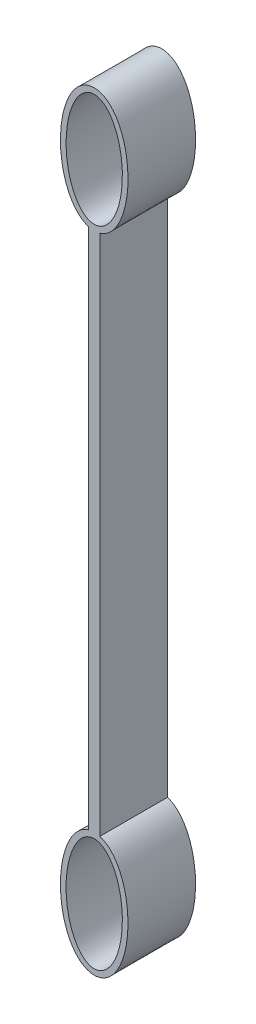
ISO-10303-21;
HEADER;
FILE_DESCRIPTION(('STEP AP214'),'2;1');
FILE_NAME('part.step','',(''),(''),'','','');
FILE_SCHEMA(('AUTOMOTIVE_DESIGN { 1 0 10303 214 1 1 1 1 }'));
ENDSEC;
DATA;
#1=APPLICATION_CONTEXT('core data for automotive mechanical design processes');
#2=APPLICATION_PROTOCOL_DEFINITION('international standard','automotive_design',2000,#1);
#3=PRODUCT_CONTEXT('',#1,'mechanical');
#4=PRODUCT('Part','Part','',(#3));
#5=PRODUCT_RELATED_PRODUCT_CATEGORY('part','',(#4));
#6=PRODUCT_DEFINITION_FORMATION('','',#4);
#7=PRODUCT_DEFINITION_CONTEXT('part definition',#1,'design');
#8=PRODUCT_DEFINITION('design','',#6,#7);
#9=PRODUCT_DEFINITION_SHAPE('','',#8);
#10=(LENGTH_UNIT() NAMED_UNIT(*) SI_UNIT(.MILLI.,.METRE.));
#11=(NAMED_UNIT(*) PLANE_ANGLE_UNIT() SI_UNIT($,.RADIAN.));
#12=(NAMED_UNIT(*) SI_UNIT($,.STERADIAN.) SOLID_ANGLE_UNIT());
#13=UNCERTAINTY_MEASURE_WITH_UNIT(LENGTH_MEASURE(1.E-05),#10,'distance_accuracy_value','');
#14=(GEOMETRIC_REPRESENTATION_CONTEXT(3) GLOBAL_UNCERTAINTY_ASSIGNED_CONTEXT((#13)) GLOBAL_UNIT_ASSIGNED_CONTEXT((#10,
#11,#12)) REPRESENTATION_CONTEXT('',''));
#15=CARTESIAN_POINT('',(0.,0.,0.));
#16=DIRECTION('',(0.,0.,1.));
#17=DIRECTION('',(1.,0.,0.));
#18=AXIS2_PLACEMENT_3D('',#15,#16,#17);
#19=CARTESIAN_POINT('',(6.35,0.,0.));
#20=DIRECTION('',(1.,0.,0.));
#21=DIRECTION('',(0.,0.,-1.));
#22=AXIS2_PLACEMENT_3D('',#19,#20,#21);
#23=PLANE('',#22);
#24=DIRECTION('',(0.,-1.,0.));
#25=VECTOR('',#24,1.);
#26=CARTESIAN_POINT('',(6.35,300.,38.1));
#27=LINE('',#26,#25);
#28=CARTESIAN_POINT('',(6.35,294.569002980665,38.1));
#29=VERTEX_POINT('',#28);
#30=CARTESIAN_POINT('',(6.35000001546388,-294.569002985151,38.1));
#31=VERTEX_POINT('',#30);
#32=EDGE_CURVE('E93',#29,#31,#27,.T.);
#33=ORIENTED_EDGE('',*,*,#32,.T.);
#34=DIRECTION('',(0.,0.,-1.));
#35=VECTOR('',#34,1.);
#36=CARTESIAN_POINT('',(6.35,-294.569002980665,38.1));
#37=LINE('',#36,#35);
#38=CARTESIAN_POINT('',(6.35000001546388,-294.569002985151,-38.1));
#39=VERTEX_POINT('',#38);
#40=EDGE_CURVE('E76',#31,#39,#37,.T.);
#41=ORIENTED_EDGE('',*,*,#40,.T.);
#42=DIRECTION('',(0.,1.,0.));
#43=VECTOR('',#42,1.);
#44=CARTESIAN_POINT('',(6.35,300.,-38.1));
#45=LINE('',#44,#43);
#46=CARTESIAN_POINT('',(6.35,294.569002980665,-38.1));
#47=VERTEX_POINT('',#46);
#48=EDGE_CURVE('E40',#39,#47,#45,.T.);
#49=ORIENTED_EDGE('',*,*,#48,.T.);
#50=DIRECTION('',(0.,0.,-1.));
#51=VECTOR('',#50,1.);
#52=CARTESIAN_POINT('',(6.35,294.569002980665,38.1));
#53=LINE('',#52,#51);
#54=EDGE_CURVE('E50',#47,#29,#53,.F.);
#55=ORIENTED_EDGE('',*,*,#54,.T.);
#56=EDGE_LOOP('',(#33,#41,#49,#55));
#57=FACE_BOUND('',#56,.T.);
#58=ADVANCED_FACE('F32',(#57),#23,.T.);
#59=CARTESIAN_POINT('',(-6.35,0.,0.));
#60=DIRECTION('',(1.,0.,0.));
#61=DIRECTION('',(0.,0.,-1.));
#62=AXIS2_PLACEMENT_3D('',#59,#60,#61);
#63=PLANE('',#62);
#64=DIRECTION('',(0.,0.,-1.));
#65=VECTOR('',#64,1.);
#66=CARTESIAN_POINT('',(-6.35,-294.569002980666,38.1));
#67=LINE('',#66,#65);
#68=CARTESIAN_POINT('',(-6.35000001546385,-294.569002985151,38.1));
#69=VERTEX_POINT('',#68);
#70=CARTESIAN_POINT('',(-6.35000001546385,-294.569002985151,-38.1));
#71=VERTEX_POINT('',#70);
#72=EDGE_CURVE('E74',#69,#71,#67,.T.);
#73=ORIENTED_EDGE('',*,*,#72,.F.);
#74=DIRECTION('',(0.,-1.,0.));
#75=VECTOR('',#74,1.);
#76=CARTESIAN_POINT('',(-6.35,300.,38.1));
#77=LINE('',#76,#75);
#78=CARTESIAN_POINT('',(-6.35000000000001,294.569002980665,38.1));
#79=VERTEX_POINT('',#78);
#80=EDGE_CURVE('E85',#79,#69,#77,.T.);
#81=ORIENTED_EDGE('',*,*,#80,.F.);
#82=DIRECTION('',(0.,0.,-1.));
#83=VECTOR('',#82,1.);
#84=CARTESIAN_POINT('',(-6.35000000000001,294.569002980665,38.1));
#85=LINE('',#84,#83);
#86=CARTESIAN_POINT('',(-6.35,294.569002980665,-38.1));
#87=VERTEX_POINT('',#86);
#88=EDGE_CURVE('E11',#87,#79,#85,.F.);
#89=ORIENTED_EDGE('',*,*,#88,.F.);
#90=DIRECTION('',(0.,1.,0.));
#91=VECTOR('',#90,1.);
#92=CARTESIAN_POINT('',(-6.35,300.,-38.1));
#93=LINE('',#92,#91);
#94=EDGE_CURVE('E86',#71,#87,#93,.T.);
#95=ORIENTED_EDGE('',*,*,#94,.F.);
#96=EDGE_LOOP('',(#73,#81,#89,#95));
#97=FACE_BOUND('',#96,.T.);
#98=ADVANCED_FACE('F83',(#97),#63,.F.);
#99=CARTESIAN_POINT('',(6.35,300.,38.1));
#100=DIRECTION('',(0.,0.,-1.));
#101=DIRECTION('',(-1.,0.,0.));
#102=AXIS2_PLACEMENT_3D('',#99,#100,#101);
#103=PLANE('',#102);
#104=ORIENTED_EDGE('',*,*,#80,.T.);
#105=CARTESIAN_POINT('',(0.,-293.65,38.1));
#106=CARTESIAN_POINT('',(-2.90429625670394,-293.65,38.1));
#107=CARTESIAN_POINT('',(-8.71288877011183,-294.822831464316,38.1));
#108=CARTESIAN_POINT('',(-16.3967252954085,-299.564444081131,38.1));
#109=CARTESIAN_POINT('',(-22.9073740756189,-306.581388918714,38.1));
#110=CARTESIAN_POINT('',(-28.3147395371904,-315.493224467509,38.1));
#111=CARTESIAN_POINT('',(-32.6151855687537,-325.999191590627,38.1));
#112=CARTESIAN_POINT('',(-36.8030834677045,-341.686787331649,38.1));
#113=CARTESIAN_POINT('',(-38.9646110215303,-363.5,38.1));
#114=CARTESIAN_POINT('',(-36.8030834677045,-385.313212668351,38.1));
#115=CARTESIAN_POINT('',(-32.6151855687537,-401.000808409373,38.1));
#116=CARTESIAN_POINT('',(-28.3147395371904,-411.506775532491,38.1));
#117=CARTESIAN_POINT('',(-22.9073740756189,-420.418611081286,38.1));
#118=CARTESIAN_POINT('',(-16.3967252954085,-427.435555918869,38.1));
#119=CARTESIAN_POINT('',(-8.71288877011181,-432.177168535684,38.1));
#120=CARTESIAN_POINT('',(0.,-433.936415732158,38.1));
#121=CARTESIAN_POINT('',(8.71288877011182,-432.177168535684,38.1));
#122=CARTESIAN_POINT('',(16.3967252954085,-427.435555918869,38.1));
#123=CARTESIAN_POINT('',(22.9073740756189,-420.418611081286,38.1));
#124=CARTESIAN_POINT('',(28.3147395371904,-411.506775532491,38.1));
#125=CARTESIAN_POINT('',(32.6151855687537,-401.000808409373,38.1));
#126=CARTESIAN_POINT('',(36.8030834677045,-385.313212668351,38.1));
#127=CARTESIAN_POINT('',(38.9646110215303,-363.5,38.1));
#128=CARTESIAN_POINT('',(36.8030834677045,-341.686787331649,38.1));
#129=CARTESIAN_POINT('',(32.6151855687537,-325.999191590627,38.1));
#130=CARTESIAN_POINT('',(28.3147395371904,-315.493224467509,38.1));
#131=CARTESIAN_POINT('',(22.9073740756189,-306.581388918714,38.1));
#132=CARTESIAN_POINT('',(16.3967252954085,-299.564444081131,38.1));
#133=CARTESIAN_POINT('',(8.71288877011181,-294.822831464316,38.1));
#134=CARTESIAN_POINT('',(2.90429625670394,-293.65,38.1));
#135=CARTESIAN_POINT('',(0.,-293.65,38.1));
#136=B_SPLINE_CURVE_WITH_KNOTS('',3,(#105,#106,#107,#108,#109,#110,#111,#112,#113,#114,#115,
#116,#117,#118,#119,#120,#121,#122,#123,#124,#125,#126,#127,#128,#129,#130,#131,#132,#133,#134,
#135),.UNSPECIFIED.,.T.,.F.,(4,1,1,1,1,1,1,1,1,1,1,1,1,1,1,1,1,1,1,1,1,1,1,1,1,1,1,1,4),(0.,
0.196349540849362,0.392699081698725,0.589048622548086,0.785398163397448,0.981747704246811,
1.17809724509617,1.5707963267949,1.96349540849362,2.15984494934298,2.35619449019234,
2.55254403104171,2.74889357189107,2.94524311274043,3.14159265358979,3.33794219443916,
3.53429173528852,3.73064127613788,3.92699081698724,4.1233403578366,4.31968989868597,
4.71238898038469,5.10508806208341,5.30143760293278,5.49778714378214,5.6941366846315,
5.89048622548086,6.08683576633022,6.28318530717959),.UNSPECIFIED.);
#137=EDGE_CURVE('E71',#69,#31,#136,.T.);
#138=ORIENTED_EDGE('',*,*,#137,.T.);
#139=ORIENTED_EDGE('',*,*,#32,.F.);
#140=CARTESIAN_POINT('',(0.,293.65,38.1));
#141=CARTESIAN_POINT('',(2.90429625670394,293.65,38.1));
#142=CARTESIAN_POINT('',(8.71288877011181,294.822831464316,38.1));
#143=CARTESIAN_POINT('',(16.3967252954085,299.564444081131,38.1));
#144=CARTESIAN_POINT('',(22.9073740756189,306.581388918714,38.1));
#145=CARTESIAN_POINT('',(28.3147395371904,315.493224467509,38.1));
#146=CARTESIAN_POINT('',(32.6151855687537,325.999191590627,38.1));
#147=CARTESIAN_POINT('',(36.8030834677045,341.686787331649,38.1));
#148=CARTESIAN_POINT('',(38.9646110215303,363.5,38.1));
#149=CARTESIAN_POINT('',(36.8030834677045,385.313212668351,38.1));
#150=CARTESIAN_POINT('',(32.6151855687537,401.000808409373,38.1));
#151=CARTESIAN_POINT('',(28.3147395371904,411.506775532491,38.1));
#152=CARTESIAN_POINT('',(22.9073740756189,420.418611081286,38.1));
#153=CARTESIAN_POINT('',(16.3967252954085,427.435555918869,38.1));
#154=CARTESIAN_POINT('',(8.71288877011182,432.177168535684,38.1));
#155=CARTESIAN_POINT('',(0.,433.936415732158,38.1));
#156=CARTESIAN_POINT('',(-8.71288877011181,432.177168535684,38.1));
#157=CARTESIAN_POINT('',(-16.3967252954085,427.435555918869,38.1));
#158=CARTESIAN_POINT('',(-22.9073740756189,420.418611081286,38.1));
#159=CARTESIAN_POINT('',(-28.3147395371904,411.506775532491,38.1));
#160=CARTESIAN_POINT('',(-32.6151855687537,401.000808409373,38.1));
#161=CARTESIAN_POINT('',(-36.8030834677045,385.313212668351,38.1));
#162=CARTESIAN_POINT('',(-38.9646110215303,363.5,38.1));
#163=CARTESIAN_POINT('',(-36.8030834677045,341.686787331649,38.1));
#164=CARTESIAN_POINT('',(-32.6151855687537,325.999191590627,38.1));
#165=CARTESIAN_POINT('',(-28.3147395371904,315.493224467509,38.1));
#166=CARTESIAN_POINT('',(-22.9073740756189,306.581388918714,38.1));
#167=CARTESIAN_POINT('',(-16.3967252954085,299.564444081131,38.1));
#168=CARTESIAN_POINT('',(-8.71288877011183,294.822831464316,38.1));
#169=CARTESIAN_POINT('',(-2.90429625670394,293.65,38.1));
#170=CARTESIAN_POINT('',(0.,293.65,38.1));
#171=B_SPLINE_CURVE_WITH_KNOTS('',3,(#140,#141,#142,#143,#144,#145,#146,#147,#148,#149,#150,
#151,#152,#153,#154,#155,#156,#157,#158,#159,#160,#161,#162,#163,#164,#165,#166,#167,#168,#169,
#170),.UNSPECIFIED.,.T.,.F.,(4,1,1,1,1,1,1,1,1,1,1,1,1,1,1,1,1,1,1,1,1,1,1,1,1,1,1,1,4),(0.,
0.196349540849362,0.392699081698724,0.589048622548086,0.785398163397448,0.98174770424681,
1.17809724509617,1.5707963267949,1.96349540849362,2.15984494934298,2.35619449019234,
2.55254403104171,2.74889357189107,2.94524311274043,3.14159265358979,3.33794219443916,
3.53429173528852,3.73064127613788,3.92699081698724,4.1233403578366,4.31968989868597,
4.71238898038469,5.10508806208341,5.30143760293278,5.49778714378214,5.6941366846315,
5.89048622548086,6.08683576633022,6.28318530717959),.UNSPECIFIED.);
#172=EDGE_CURVE('E91',#29,#79,#171,.T.);
#173=ORIENTED_EDGE('',*,*,#172,.T.);
#174=EDGE_LOOP('',(#104,#138,#139,#173));
#175=FACE_BOUND('',#174,.T.);
#176=CARTESIAN_POINT('',(0.,363.5,38.1));
#177=DIRECTION('',(0.,0.,1.));
#178=DIRECTION('',(0.,-1.,0.));
#179=AXIS2_PLACEMENT_3D('',#176,#177,#178);
#180=ELLIPSE('',#179,63.5,31.75);
#181=CARTESIAN_POINT('',(0.,300.,38.1));
#182=VERTEX_POINT('',#181);
#183=EDGE_CURVE('E103',#182,#182,#180,.T.);
#184=ORIENTED_EDGE('',*,*,#183,.F.);
#185=EDGE_LOOP('',(#184));
#186=FACE_BOUND('',#185,.T.);
#187=CARTESIAN_POINT('',(0.,-363.5,38.1));
#188=DIRECTION('',(0.,0.,1.));
#189=DIRECTION('',(0.,1.,0.));
#190=AXIS2_PLACEMENT_3D('',#187,#188,#189);
#191=ELLIPSE('',#190,63.5,31.75);
#192=CARTESIAN_POINT('',(0.,-300.,38.1));
#193=VERTEX_POINT('',#192);
#194=EDGE_CURVE('E148',#193,#193,#191,.T.);
#195=ORIENTED_EDGE('',*,*,#194,.F.);
#196=EDGE_LOOP('',(#195));
#197=FACE_BOUND('',#196,.T.);
#198=ADVANCED_FACE('F34',(#175,#186,#197),#103,.F.);
#199=CARTESIAN_POINT('',(6.35,300.,-38.1));
#200=DIRECTION('',(0.,0.,1.));
#201=DIRECTION('',(1.,0.,0.));
#202=AXIS2_PLACEMENT_3D('',#199,#200,#201);
#203=PLANE('',#202);
#204=ORIENTED_EDGE('',*,*,#48,.F.);
#205=CARTESIAN_POINT('',(0.,-293.65,-38.1));
#206=CARTESIAN_POINT('',(-2.90429625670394,-293.65,-38.1));
#207=CARTESIAN_POINT('',(-8.71288877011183,-294.822831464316,-38.1));
#208=CARTESIAN_POINT('',(-16.3967252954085,-299.564444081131,-38.1));
#209=CARTESIAN_POINT('',(-22.9073740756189,-306.581388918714,-38.1));
#210=CARTESIAN_POINT('',(-28.3147395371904,-315.493224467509,-38.1));
#211=CARTESIAN_POINT('',(-32.6151855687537,-325.999191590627,-38.1));
#212=CARTESIAN_POINT('',(-36.8030834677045,-341.686787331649,-38.1));
#213=CARTESIAN_POINT('',(-38.9646110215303,-363.5,-38.1));
#214=CARTESIAN_POINT('',(-36.8030834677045,-385.313212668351,-38.1));
#215=CARTESIAN_POINT('',(-32.6151855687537,-401.000808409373,-38.1));
#216=CARTESIAN_POINT('',(-28.3147395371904,-411.506775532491,-38.1));
#217=CARTESIAN_POINT('',(-22.9073740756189,-420.418611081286,-38.1));
#218=CARTESIAN_POINT('',(-16.3967252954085,-427.435555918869,-38.1));
#219=CARTESIAN_POINT('',(-8.71288877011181,-432.177168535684,-38.1));
#220=CARTESIAN_POINT('',(0.,-433.936415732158,-38.1));
#221=CARTESIAN_POINT('',(8.71288877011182,-432.177168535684,-38.1));
#222=CARTESIAN_POINT('',(16.3967252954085,-427.435555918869,-38.1));
#223=CARTESIAN_POINT('',(22.9073740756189,-420.418611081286,-38.1));
#224=CARTESIAN_POINT('',(28.3147395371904,-411.506775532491,-38.1));
#225=CARTESIAN_POINT('',(32.6151855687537,-401.000808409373,-38.1));
#226=CARTESIAN_POINT('',(36.8030834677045,-385.313212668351,-38.1));
#227=CARTESIAN_POINT('',(38.9646110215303,-363.5,-38.1));
#228=CARTESIAN_POINT('',(36.8030834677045,-341.686787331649,-38.1));
#229=CARTESIAN_POINT('',(32.6151855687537,-325.999191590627,-38.1));
#230=CARTESIAN_POINT('',(28.3147395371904,-315.493224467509,-38.1));
#231=CARTESIAN_POINT('',(22.9073740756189,-306.581388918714,-38.1));
#232=CARTESIAN_POINT('',(16.3967252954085,-299.564444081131,-38.1));
#233=CARTESIAN_POINT('',(8.71288877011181,-294.822831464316,-38.1));
#234=CARTESIAN_POINT('',(2.90429625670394,-293.65,-38.1));
#235=CARTESIAN_POINT('',(0.,-293.65,-38.1));
#236=B_SPLINE_CURVE_WITH_KNOTS('',3,(#205,#206,#207,#208,#209,#210,#211,#212,#213,#214,#215,
#216,#217,#218,#219,#220,#221,#222,#223,#224,#225,#226,#227,#228,#229,#230,#231,#232,#233,#234,
#235),.UNSPECIFIED.,.T.,.F.,(4,1,1,1,1,1,1,1,1,1,1,1,1,1,1,1,1,1,1,1,1,1,1,1,1,1,1,1,4),(0.,
0.196349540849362,0.392699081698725,0.589048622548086,0.785398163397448,0.981747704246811,
1.17809724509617,1.5707963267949,1.96349540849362,2.15984494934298,2.35619449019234,
2.55254403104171,2.74889357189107,2.94524311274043,3.14159265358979,3.33794219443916,
3.53429173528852,3.73064127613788,3.92699081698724,4.1233403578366,4.31968989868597,
4.71238898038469,5.10508806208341,5.30143760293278,5.49778714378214,5.6941366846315,
5.89048622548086,6.08683576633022,6.28318530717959),.UNSPECIFIED.);
#237=EDGE_CURVE('E79',#71,#39,#236,.T.);
#238=ORIENTED_EDGE('',*,*,#237,.F.);
#239=ORIENTED_EDGE('',*,*,#94,.T.);
#240=CARTESIAN_POINT('',(0.,293.65,-38.1));
#241=CARTESIAN_POINT('',(2.90429625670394,293.65,-38.1));
#242=CARTESIAN_POINT('',(8.71288877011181,294.822831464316,-38.1));
#243=CARTESIAN_POINT('',(16.3967252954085,299.564444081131,-38.1));
#244=CARTESIAN_POINT('',(22.9073740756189,306.581388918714,-38.1));
#245=CARTESIAN_POINT('',(28.3147395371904,315.493224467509,-38.1));
#246=CARTESIAN_POINT('',(32.6151855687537,325.999191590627,-38.1));
#247=CARTESIAN_POINT('',(36.8030834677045,341.686787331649,-38.1));
#248=CARTESIAN_POINT('',(38.9646110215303,363.5,-38.1));
#249=CARTESIAN_POINT('',(36.8030834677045,385.313212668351,-38.1));
#250=CARTESIAN_POINT('',(32.6151855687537,401.000808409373,-38.1));
#251=CARTESIAN_POINT('',(28.3147395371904,411.506775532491,-38.1));
#252=CARTESIAN_POINT('',(22.9073740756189,420.418611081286,-38.1));
#253=CARTESIAN_POINT('',(16.3967252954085,427.435555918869,-38.1));
#254=CARTESIAN_POINT('',(8.71288877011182,432.177168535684,-38.1));
#255=CARTESIAN_POINT('',(0.,433.936415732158,-38.1));
#256=CARTESIAN_POINT('',(-8.71288877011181,432.177168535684,-38.1));
#257=CARTESIAN_POINT('',(-16.3967252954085,427.435555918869,-38.1));
#258=CARTESIAN_POINT('',(-22.9073740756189,420.418611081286,-38.1));
#259=CARTESIAN_POINT('',(-28.3147395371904,411.506775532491,-38.1));
#260=CARTESIAN_POINT('',(-32.6151855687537,401.000808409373,-38.1));
#261=CARTESIAN_POINT('',(-36.8030834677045,385.313212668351,-38.1));
#262=CARTESIAN_POINT('',(-38.9646110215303,363.5,-38.1));
#263=CARTESIAN_POINT('',(-36.8030834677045,341.686787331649,-38.1));
#264=CARTESIAN_POINT('',(-32.6151855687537,325.999191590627,-38.1));
#265=CARTESIAN_POINT('',(-28.3147395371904,315.493224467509,-38.1));
#266=CARTESIAN_POINT('',(-22.9073740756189,306.581388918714,-38.1));
#267=CARTESIAN_POINT('',(-16.3967252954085,299.564444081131,-38.1));
#268=CARTESIAN_POINT('',(-8.71288877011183,294.822831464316,-38.1));
#269=CARTESIAN_POINT('',(-2.90429625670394,293.65,-38.1));
#270=CARTESIAN_POINT('',(0.,293.65,-38.1));
#271=B_SPLINE_CURVE_WITH_KNOTS('',3,(#240,#241,#242,#243,#244,#245,#246,#247,#248,#249,#250,
#251,#252,#253,#254,#255,#256,#257,#258,#259,#260,#261,#262,#263,#264,#265,#266,#267,#268,#269,
#270),.UNSPECIFIED.,.T.,.F.,(4,1,1,1,1,1,1,1,1,1,1,1,1,1,1,1,1,1,1,1,1,1,1,1,1,1,1,1,4),(0.,
0.196349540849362,0.392699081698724,0.589048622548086,0.785398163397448,0.98174770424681,
1.17809724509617,1.5707963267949,1.96349540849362,2.15984494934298,2.35619449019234,
2.55254403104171,2.74889357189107,2.94524311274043,3.14159265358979,3.33794219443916,
3.53429173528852,3.73064127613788,3.92699081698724,4.1233403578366,4.31968989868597,
4.71238898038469,5.10508806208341,5.30143760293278,5.49778714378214,5.6941366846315,
5.89048622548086,6.08683576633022,6.28318530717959),.UNSPECIFIED.);
#272=EDGE_CURVE('E98',#47,#87,#271,.T.);
#273=ORIENTED_EDGE('',*,*,#272,.F.);
#274=EDGE_LOOP('',(#204,#238,#239,#273));
#275=FACE_BOUND('',#274,.T.);
#276=CARTESIAN_POINT('',(0.,-363.5,-38.1));
#277=DIRECTION('',(0.,0.,1.));
#278=DIRECTION('',(0.,1.,0.));
#279=AXIS2_PLACEMENT_3D('',#276,#277,#278);
#280=ELLIPSE('',#279,63.5,31.75);
#281=CARTESIAN_POINT('',(0.,-300.,-38.1));
#282=VERTEX_POINT('',#281);
#283=EDGE_CURVE('E138',#282,#282,#280,.T.);
#284=ORIENTED_EDGE('',*,*,#283,.T.);
#285=EDGE_LOOP('',(#284));
#286=FACE_BOUND('',#285,.T.);
#287=CARTESIAN_POINT('',(0.,363.5,-38.1));
#288=DIRECTION('',(0.,0.,1.));
#289=DIRECTION('',(0.,-1.,0.));
#290=AXIS2_PLACEMENT_3D('',#287,#288,#289);
#291=ELLIPSE('',#290,63.5,31.75);
#292=CARTESIAN_POINT('',(0.,300.,-38.1));
#293=VERTEX_POINT('',#292);
#294=EDGE_CURVE('E111',#293,#293,#291,.T.);
#295=ORIENTED_EDGE('',*,*,#294,.T.);
#296=EDGE_LOOP('',(#295));
#297=FACE_BOUND('',#296,.T.);
#298=ADVANCED_FACE('F122',(#275,#286,#297),#203,.F.);
#299=DIRECTION('',(0.,0.,-1.));
#300=VECTOR('',#299,1.);
#301=SURFACE_OF_LINEAR_EXTRUSION('',#171,#300);
#302=ORIENTED_EDGE('',*,*,#54,.F.);
#303=ORIENTED_EDGE('',*,*,#272,.T.);
#304=ORIENTED_EDGE('',*,*,#88,.T.);
#305=ORIENTED_EDGE('',*,*,#172,.F.);
#306=EDGE_LOOP('',(#302,#303,#304,#305));
#307=FACE_BOUND('',#306,.T.);
#308=ADVANCED_FACE('F117',(#307),#301,.F.);
#309=DIRECTION('',(0.,0.,-1.));
#310=VECTOR('',#309,1.);
#311=SURFACE_OF_LINEAR_EXTRUSION('',#180,#310);
#312=ORIENTED_EDGE('',*,*,#294,.F.);
#313=EDGE_LOOP('',(#312));
#314=FACE_BOUND('',#313,.T.);
#315=ORIENTED_EDGE('',*,*,#183,.T.);
#316=EDGE_LOOP('',(#315));
#317=FACE_BOUND('',#316,.T.);
#318=ADVANCED_FACE('F121',(#314,#317),#311,.T.);
#319=DIRECTION('',(0.,0.,-1.));
#320=VECTOR('',#319,1.);
#321=SURFACE_OF_LINEAR_EXTRUSION('',#136,#320);
#322=ORIENTED_EDGE('',*,*,#40,.F.);
#323=ORIENTED_EDGE('',*,*,#137,.F.);
#324=ORIENTED_EDGE('',*,*,#72,.T.);
#325=ORIENTED_EDGE('',*,*,#237,.T.);
#326=EDGE_LOOP('',(#322,#323,#324,#325));
#327=FACE_BOUND('',#326,.T.);
#328=ADVANCED_FACE('F73',(#327),#321,.F.);
#329=DIRECTION('',(0.,0.,-1.));
#330=VECTOR('',#329,1.);
#331=SURFACE_OF_LINEAR_EXTRUSION('',#191,#330);
#332=ORIENTED_EDGE('',*,*,#283,.F.);
#333=EDGE_LOOP('',(#332));
#334=FACE_BOUND('',#333,.T.);
#335=ORIENTED_EDGE('',*,*,#194,.T.);
#336=EDGE_LOOP('',(#335));
#337=FACE_BOUND('',#336,.T.);
#338=ADVANCED_FACE('F162',(#334,#337),#331,.T.);
#339=CLOSED_SHELL('',(#58,#98,#198,#298,#308,#318,#328,#338));
#340=MANIFOLD_SOLID_BREP('B2',#339);
#341=ADVANCED_BREP_SHAPE_REPRESENTATION('',(#18,#340),#14);
#342=SHAPE_DEFINITION_REPRESENTATION(#9,#341);
ENDSEC;
END-ISO-10303-21;
